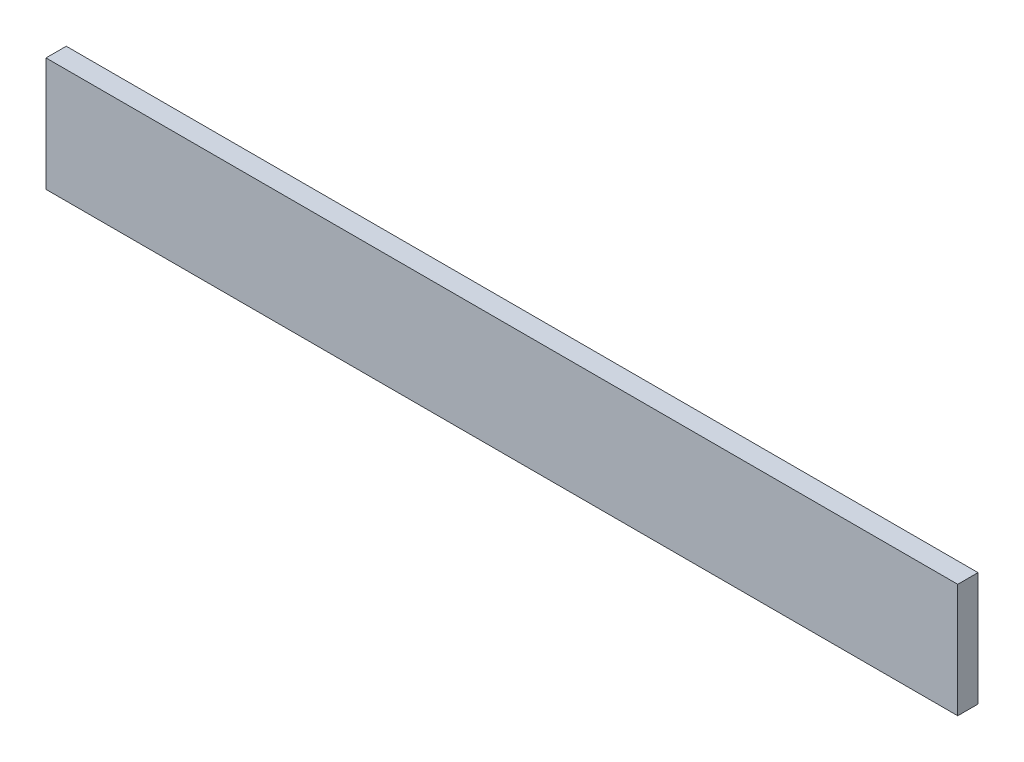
ISO-10303-21;
HEADER;
FILE_DESCRIPTION(('STEP AP214'),'2;1');
FILE_NAME('part.step','',(''),(''),'','','');
FILE_SCHEMA(('AUTOMOTIVE_DESIGN { 1 0 10303 214 1 1 1 1 }'));
ENDSEC;
DATA;
#1=APPLICATION_CONTEXT('core data for automotive mechanical design processes');
#2=APPLICATION_PROTOCOL_DEFINITION('international standard','automotive_design',2000,#1);
#3=PRODUCT_CONTEXT('',#1,'mechanical');
#4=PRODUCT('Part','Part','',(#3));
#5=PRODUCT_RELATED_PRODUCT_CATEGORY('part','',(#4));
#6=PRODUCT_DEFINITION_FORMATION('','',#4);
#7=PRODUCT_DEFINITION_CONTEXT('part definition',#1,'design');
#8=PRODUCT_DEFINITION('design','',#6,#7);
#9=PRODUCT_DEFINITION_SHAPE('','',#8);
#10=(LENGTH_UNIT() NAMED_UNIT(*) SI_UNIT(.MILLI.,.METRE.));
#11=(NAMED_UNIT(*) PLANE_ANGLE_UNIT() SI_UNIT($,.RADIAN.));
#12=(NAMED_UNIT(*) SI_UNIT($,.STERADIAN.) SOLID_ANGLE_UNIT());
#13=UNCERTAINTY_MEASURE_WITH_UNIT(LENGTH_MEASURE(1.E-05),#10,'distance_accuracy_value','');
#14=(GEOMETRIC_REPRESENTATION_CONTEXT(3) GLOBAL_UNCERTAINTY_ASSIGNED_CONTEXT((#13)) GLOBAL_UNIT_ASSIGNED_CONTEXT((#10,
#11,#12)) REPRESENTATION_CONTEXT('',''));
#15=CARTESIAN_POINT('',(0.,0.,0.));
#16=DIRECTION('',(0.,0.,1.));
#17=DIRECTION('',(1.,0.,0.));
#18=AXIS2_PLACEMENT_3D('',#15,#16,#17);
#19=CARTESIAN_POINT('',(-285.75,35.687,12.7));
#20=DIRECTION('',(1.,0.,0.));
#21=DIRECTION('',(0.,0.,-1.));
#22=AXIS2_PLACEMENT_3D('',#19,#20,#21);
#23=PLANE('',#22);
#24=DIRECTION('',(0.,-1.,0.));
#25=VECTOR('',#24,1.);
#26=CARTESIAN_POINT('',(-285.75,35.687,0.));
#27=LINE('',#26,#25);
#28=CARTESIAN_POINT('',(-285.75,35.687,0.));
#29=VERTEX_POINT('',#28);
#30=CARTESIAN_POINT('',(-285.75,-35.687,0.));
#31=VERTEX_POINT('',#30);
#32=EDGE_CURVE('E96',#29,#31,#27,.T.);
#33=ORIENTED_EDGE('',*,*,#32,.T.);
#34=DIRECTION('',(0.,0.,-1.));
#35=VECTOR('',#34,1.);
#36=CARTESIAN_POINT('',(-285.75,-35.687,12.7));
#37=LINE('',#36,#35);
#38=CARTESIAN_POINT('',(-285.75,-35.687,12.7));
#39=VERTEX_POINT('',#38);
#40=EDGE_CURVE('E11',#39,#31,#37,.T.);
#41=ORIENTED_EDGE('',*,*,#40,.F.);
#42=DIRECTION('',(0.,-1.,0.));
#43=VECTOR('',#42,1.);
#44=CARTESIAN_POINT('',(-285.75,35.687,12.7));
#45=LINE('',#44,#43);
#46=CARTESIAN_POINT('',(-285.75,35.687,12.7));
#47=VERTEX_POINT('',#46);
#48=EDGE_CURVE('E84',#47,#39,#45,.T.);
#49=ORIENTED_EDGE('',*,*,#48,.F.);
#50=DIRECTION('',(0.,0.,-1.));
#51=VECTOR('',#50,1.);
#52=CARTESIAN_POINT('',(-285.75,35.687,12.7));
#53=LINE('',#52,#51);
#54=EDGE_CURVE('E92',#47,#29,#53,.T.);
#55=ORIENTED_EDGE('',*,*,#54,.T.);
#56=EDGE_LOOP('',(#33,#41,#49,#55));
#57=FACE_BOUND('',#56,.T.);
#58=ADVANCED_FACE('F33',(#57),#23,.F.);
#59=CARTESIAN_POINT('',(285.75,-35.687,12.7));
#60=DIRECTION('',(0.,1.,0.));
#61=DIRECTION('',(-1.,0.,0.));
#62=AXIS2_PLACEMENT_3D('',#59,#60,#61);
#63=PLANE('',#62);
#64=DIRECTION('',(1.,0.,0.));
#65=VECTOR('',#64,1.);
#66=CARTESIAN_POINT('',(285.75,-35.687,0.));
#67=LINE('',#66,#65);
#68=CARTESIAN_POINT('',(285.75,-35.687,0.));
#69=VERTEX_POINT('',#68);
#70=EDGE_CURVE('E88',#31,#69,#67,.T.);
#71=ORIENTED_EDGE('',*,*,#70,.T.);
#72=DIRECTION('',(0.,0.,-1.));
#73=VECTOR('',#72,1.);
#74=CARTESIAN_POINT('',(285.75,-35.687,12.7));
#75=LINE('',#74,#73);
#76=CARTESIAN_POINT('',(285.75,-35.687,12.7));
#77=VERTEX_POINT('',#76);
#78=EDGE_CURVE('E41',#77,#69,#75,.T.);
#79=ORIENTED_EDGE('',*,*,#78,.F.);
#80=DIRECTION('',(1.,0.,0.));
#81=VECTOR('',#80,1.);
#82=CARTESIAN_POINT('',(285.75,-35.687,12.7));
#83=LINE('',#82,#81);
#84=EDGE_CURVE('E79',#39,#77,#83,.T.);
#85=ORIENTED_EDGE('',*,*,#84,.F.);
#86=ORIENTED_EDGE('',*,*,#40,.T.);
#87=EDGE_LOOP('',(#71,#79,#85,#86));
#88=FACE_BOUND('',#87,.T.);
#89=ADVANCED_FACE('F87',(#88),#63,.F.);
#90=CARTESIAN_POINT('',(285.75,35.687,12.7));
#91=DIRECTION('',(-1.,0.,0.));
#92=DIRECTION('',(0.,0.,1.));
#93=AXIS2_PLACEMENT_3D('',#90,#91,#92);
#94=PLANE('',#93);
#95=DIRECTION('',(0.,1.,0.));
#96=VECTOR('',#95,1.);
#97=CARTESIAN_POINT('',(285.75,35.687,0.));
#98=LINE('',#97,#96);
#99=CARTESIAN_POINT('',(285.75,35.687,0.));
#100=VERTEX_POINT('',#99);
#101=EDGE_CURVE('E66',#69,#100,#98,.T.);
#102=ORIENTED_EDGE('',*,*,#101,.T.);
#103=DIRECTION('',(0.,0.,-1.));
#104=VECTOR('',#103,1.);
#105=CARTESIAN_POINT('',(285.75,35.687,12.7));
#106=LINE('',#105,#104);
#107=CARTESIAN_POINT('',(285.75,35.687,12.7));
#108=VERTEX_POINT('',#107);
#109=EDGE_CURVE('E89',#108,#100,#106,.T.);
#110=ORIENTED_EDGE('',*,*,#109,.F.);
#111=DIRECTION('',(0.,1.,0.));
#112=VECTOR('',#111,1.);
#113=CARTESIAN_POINT('',(285.75,35.687,12.7));
#114=LINE('',#113,#112);
#115=EDGE_CURVE('E82',#77,#108,#114,.T.);
#116=ORIENTED_EDGE('',*,*,#115,.F.);
#117=ORIENTED_EDGE('',*,*,#78,.T.);
#118=EDGE_LOOP('',(#102,#110,#116,#117));
#119=FACE_BOUND('',#118,.T.);
#120=ADVANCED_FACE('F90',(#119),#94,.F.);
#121=CARTESIAN_POINT('',(285.75,35.687,12.7));
#122=DIRECTION('',(0.,-1.,0.));
#123=DIRECTION('',(1.,0.,0.));
#124=AXIS2_PLACEMENT_3D('',#121,#122,#123);
#125=PLANE('',#124);
#126=DIRECTION('',(-1.,0.,0.));
#127=VECTOR('',#126,1.);
#128=CARTESIAN_POINT('',(285.75,35.687,0.));
#129=LINE('',#128,#127);
#130=EDGE_CURVE('E72',#100,#29,#129,.T.);
#131=ORIENTED_EDGE('',*,*,#130,.T.);
#132=ORIENTED_EDGE('',*,*,#54,.F.);
#133=DIRECTION('',(-1.,0.,0.));
#134=VECTOR('',#133,1.);
#135=CARTESIAN_POINT('',(285.75,35.687,12.7));
#136=LINE('',#135,#134);
#137=EDGE_CURVE('E49',#108,#47,#136,.T.);
#138=ORIENTED_EDGE('',*,*,#137,.F.);
#139=ORIENTED_EDGE('',*,*,#109,.T.);
#140=EDGE_LOOP('',(#131,#132,#138,#139));
#141=FACE_BOUND('',#140,.T.);
#142=ADVANCED_FACE('F103',(#141),#125,.F.);
#143=CARTESIAN_POINT('',(0.,0.,12.7));
#144=DIRECTION('',(0.,0.,-1.));
#145=DIRECTION('',(-1.,0.,0.));
#146=AXIS2_PLACEMENT_3D('',#143,#144,#145);
#147=PLANE('',#146);
#148=ORIENTED_EDGE('',*,*,#48,.T.);
#149=ORIENTED_EDGE('',*,*,#84,.T.);
#150=ORIENTED_EDGE('',*,*,#115,.T.);
#151=ORIENTED_EDGE('',*,*,#137,.T.);
#152=EDGE_LOOP('',(#148,#149,#150,#151));
#153=FACE_BOUND('',#152,.T.);
#154=ADVANCED_FACE('F80',(#153),#147,.F.);
#155=CARTESIAN_POINT('',(0.,0.,0.));
#156=DIRECTION('',(0.,0.,-1.));
#157=DIRECTION('',(-1.,0.,0.));
#158=AXIS2_PLACEMENT_3D('',#155,#156,#157);
#159=PLANE('',#158);
#160=ORIENTED_EDGE('',*,*,#32,.F.);
#161=ORIENTED_EDGE('',*,*,#130,.F.);
#162=ORIENTED_EDGE('',*,*,#101,.F.);
#163=ORIENTED_EDGE('',*,*,#70,.F.);
#164=EDGE_LOOP('',(#160,#161,#162,#163));
#165=FACE_BOUND('',#164,.T.);
#166=ADVANCED_FACE('F106',(#165),#159,.T.);
#167=CLOSED_SHELL('',(#58,#89,#120,#142,#154,#166));
#168=MANIFOLD_SOLID_BREP('B2',#167);
#169=ADVANCED_BREP_SHAPE_REPRESENTATION('',(#18,#168),#14);
#170=SHAPE_DEFINITION_REPRESENTATION(#9,#169);
ENDSEC;
END-ISO-10303-21;
